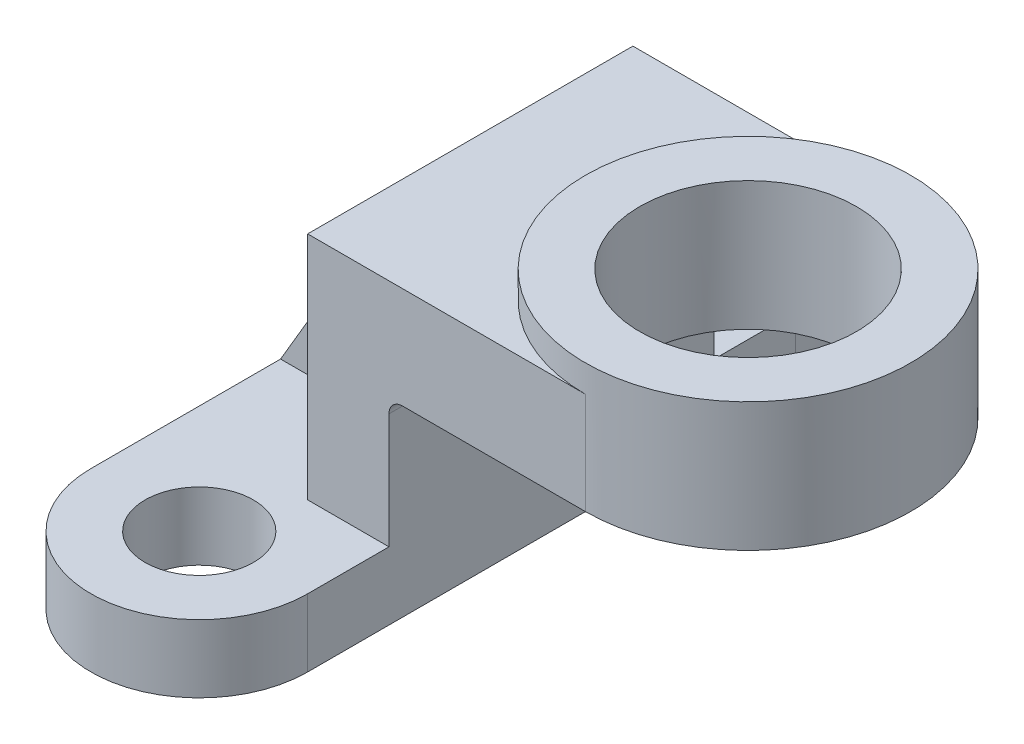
ISO-10303-21;
HEADER;
FILE_DESCRIPTION(('STEP AP214'),'2;1');
FILE_NAME('part.step','',(''),(''),'','','');
FILE_SCHEMA(('AUTOMOTIVE_DESIGN { 1 0 10303 214 1 1 1 1 }'));
ENDSEC;
DATA;
#1=APPLICATION_CONTEXT('core data for automotive mechanical design processes');
#2=APPLICATION_PROTOCOL_DEFINITION('international standard','automotive_design',2000,#1);
#3=PRODUCT_CONTEXT('',#1,'mechanical');
#4=PRODUCT('Part','Part','',(#3));
#5=PRODUCT_RELATED_PRODUCT_CATEGORY('part','',(#4));
#6=PRODUCT_DEFINITION_FORMATION('','',#4);
#7=PRODUCT_DEFINITION_CONTEXT('part definition',#1,'design');
#8=PRODUCT_DEFINITION('design','',#6,#7);
#9=PRODUCT_DEFINITION_SHAPE('','',#8);
#10=(LENGTH_UNIT() NAMED_UNIT(*) SI_UNIT(.MILLI.,.METRE.));
#11=(NAMED_UNIT(*) PLANE_ANGLE_UNIT() SI_UNIT($,.RADIAN.));
#12=(NAMED_UNIT(*) SI_UNIT($,.STERADIAN.) SOLID_ANGLE_UNIT());
#13=UNCERTAINTY_MEASURE_WITH_UNIT(LENGTH_MEASURE(1.E-05),#10,'distance_accuracy_value','');
#14=(GEOMETRIC_REPRESENTATION_CONTEXT(3) GLOBAL_UNCERTAINTY_ASSIGNED_CONTEXT((#13)) GLOBAL_UNIT_ASSIGNED_CONTEXT((#10,
#11,#12)) REPRESENTATION_CONTEXT('',''));
#15=CARTESIAN_POINT('',(0.,0.,0.));
#16=DIRECTION('',(0.,0.,1.));
#17=DIRECTION('',(1.,0.,0.));
#18=AXIS2_PLACEMENT_3D('',#15,#16,#17);
#19=CARTESIAN_POINT('',(0.,10.,0.));
#20=DIRECTION('',(0.,1.,0.));
#21=DIRECTION('',(0.,0.,1.));
#22=AXIS2_PLACEMENT_3D('',#19,#20,#21);
#23=PLANE('',#22);
#24=CARTESIAN_POINT('',(0.,10.,-36.));
#25=DIRECTION('',(0.,1.,0.));
#26=DIRECTION('',(0.,0.,1.));
#27=AXIS2_PLACEMENT_3D('',#24,#25,#26);
#28=CIRCLE('',#27,8.);
#29=CARTESIAN_POINT('',(0.,10.,-28.));
#30=VERTEX_POINT('',#29);
#31=EDGE_CURVE('E201',#30,#30,#28,.T.);
#32=ORIENTED_EDGE('',*,*,#31,.F.);
#33=EDGE_LOOP('',(#32));
#34=FACE_BOUND('',#33,.T.);
#35=DIRECTION('',(0.,0.,1.));
#36=VECTOR('',#35,1.);
#37=CARTESIAN_POINT('',(-16.,10.,0.));
#38=LINE('',#37,#36);
#39=CARTESIAN_POINT('',(-16.,10.,-36.));
#40=VERTEX_POINT('',#39);
#41=CARTESIAN_POINT('',(-16.,10.,-8.));
#42=VERTEX_POINT('',#41);
#43=EDGE_CURVE('E211',#40,#42,#38,.T.);
#44=ORIENTED_EDGE('',*,*,#43,.T.);
#45=DIRECTION('',(1.,0.,0.));
#46=VECTOR('',#45,1.);
#47=CARTESIAN_POINT('',(0.,10.,-8.));
#48=LINE('',#47,#46);
#49=CARTESIAN_POINT('',(4.,10.,-8.));
#50=VERTEX_POINT('',#49);
#51=EDGE_CURVE('E164',#42,#50,#48,.T.);
#52=ORIENTED_EDGE('',*,*,#51,.T.);
#53=DIRECTION('',(0.,0.,1.));
#54=VECTOR('',#53,1.);
#55=CARTESIAN_POINT('',(4.,10.,-24.));
#56=LINE('',#55,#54);
#57=CARTESIAN_POINT('',(4.,10.,-24.));
#58=VERTEX_POINT('',#57);
#59=EDGE_CURVE('E173',#58,#50,#56,.T.);
#60=ORIENTED_EDGE('',*,*,#59,.F.);
#61=DIRECTION('',(1.,0.,0.));
#62=VECTOR('',#61,1.);
#63=CARTESIAN_POINT('',(4.,10.,-24.));
#64=LINE('',#63,#62);
#65=CARTESIAN_POINT('',(16.,10.,-24.));
#66=VERTEX_POINT('',#65);
#67=EDGE_CURVE('E304',#58,#66,#64,.T.);
#68=ORIENTED_EDGE('',*,*,#67,.T.);
#69=DIRECTION('',(0.,0.,1.));
#70=VECTOR('',#69,1.);
#71=CARTESIAN_POINT('',(16.,10.,0.));
#72=LINE('',#71,#70);
#73=CARTESIAN_POINT('',(16.,10.,-36.));
#74=VERTEX_POINT('',#73);
#75=EDGE_CURVE('E220',#74,#66,#72,.T.);
#76=ORIENTED_EDGE('',*,*,#75,.F.);
#77=CARTESIAN_POINT('',(0.,10.,-36.));
#78=DIRECTION('',(0.,1.,0.));
#79=DIRECTION('',(0.,0.,1.));
#80=AXIS2_PLACEMENT_3D('',#77,#78,#79);
#81=CIRCLE('',#80,16.);
#82=EDGE_CURVE('E205',#74,#40,#81,.T.);
#83=ORIENTED_EDGE('',*,*,#82,.T.);
#84=EDGE_LOOP('',(#44,#52,#60,#68,#76,#83));
#85=FACE_BOUND('',#84,.T.);
#86=ADVANCED_FACE('F45',(#34,#85),#23,.T.);
#87=CARTESIAN_POINT('',(4.,44.,-24.));
#88=DIRECTION('',(-1.,0.,0.));
#89=DIRECTION('',(0.,-1.,0.));
#90=AXIS2_PLACEMENT_3D('',#87,#88,#89);
#91=PLANE('',#90);
#92=ORIENTED_EDGE('',*,*,#59,.T.);
#93=DIRECTION('',(0.,1.,0.));
#94=VECTOR('',#93,1.);
#95=CARTESIAN_POINT('',(4.,44.,-8.));
#96=LINE('',#95,#94);
#97=CARTESIAN_POINT('',(4.,44.,-8.));
#98=VERTEX_POINT('',#97);
#99=EDGE_CURVE('E162',#50,#98,#96,.T.);
#100=ORIENTED_EDGE('',*,*,#99,.T.);
#101=DIRECTION('',(0.,0.,1.));
#102=VECTOR('',#101,1.);
#103=CARTESIAN_POINT('',(4.,44.,-24.));
#104=LINE('',#103,#102);
#105=CARTESIAN_POINT('',(4.,44.,-24.));
#106=VERTEX_POINT('',#105);
#107=EDGE_CURVE('E156',#106,#98,#104,.T.);
#108=ORIENTED_EDGE('',*,*,#107,.F.);
#109=DIRECTION('',(0.,-1.,0.));
#110=VECTOR('',#109,1.);
#111=CARTESIAN_POINT('',(4.,44.,-24.));
#112=LINE('',#111,#110);
#113=EDGE_CURVE('E198',#106,#58,#112,.T.);
#114=ORIENTED_EDGE('',*,*,#113,.T.);
#115=EDGE_LOOP('',(#92,#100,#108,#114));
#116=FACE_BOUND('',#115,.T.);
#117=ADVANCED_FACE('F169',(#116),#91,.T.);
#118=CARTESIAN_POINT('',(0.,10.,-36.));
#119=DIRECTION('',(0.,-1.,0.));
#120=DIRECTION('',(0.,0.,-1.));
#121=AXIS2_PLACEMENT_3D('',#118,#119,#120);
#122=CYLINDRICAL_SURFACE('',#121,16.);
#123=CARTESIAN_POINT('',(0.,0.,-36.));
#124=DIRECTION('',(0.,1.,0.));
#125=DIRECTION('',(0.,0.,1.));
#126=AXIS2_PLACEMENT_3D('',#123,#124,#125);
#127=CIRCLE('',#126,16.);
#128=CARTESIAN_POINT('',(16.,0.,-36.));
#129=VERTEX_POINT('',#128);
#130=CARTESIAN_POINT('',(-16.,0.,-36.));
#131=VERTEX_POINT('',#130);
#132=EDGE_CURVE('E233',#129,#131,#127,.T.);
#133=ORIENTED_EDGE('',*,*,#132,.T.);
#134=DIRECTION('',(0.,-1.,0.));
#135=VECTOR('',#134,1.);
#136=CARTESIAN_POINT('',(-16.,10.,-36.));
#137=LINE('',#136,#135);
#138=EDGE_CURVE('E11',#40,#131,#137,.T.);
#139=ORIENTED_EDGE('',*,*,#138,.F.);
#140=ORIENTED_EDGE('',*,*,#82,.F.);
#141=DIRECTION('',(0.,-1.,0.));
#142=VECTOR('',#141,1.);
#143=CARTESIAN_POINT('',(16.,10.,-36.));
#144=LINE('',#143,#142);
#145=EDGE_CURVE('E228',#74,#129,#144,.T.);
#146=ORIENTED_EDGE('',*,*,#145,.T.);
#147=EDGE_LOOP('',(#133,#139,#140,#146));
#148=FACE_BOUND('',#147,.T.);
#149=ADVANCED_FACE('F373',(#148),#122,.T.);
#150=CARTESIAN_POINT('',(-16.,10.,0.));
#151=DIRECTION('',(1.,0.,0.));
#152=DIRECTION('',(0.,0.,-1.));
#153=AXIS2_PLACEMENT_3D('',#150,#151,#152);
#154=PLANE('',#153);
#155=CARTESIAN_POINT('',(-16.,10.,8.));
#156=VERTEX_POINT('',#155);
#157=CARTESIAN_POINT('',(-16.,10.,36.));
#158=VERTEX_POINT('',#157);
#159=EDGE_CURVE('E210',#156,#158,#38,.T.);
#160=ORIENTED_EDGE('',*,*,#159,.F.);
#161=DIRECTION('',(0.,0.,1.));
#162=VECTOR('',#161,1.);
#163=CARTESIAN_POINT('',(-16.,10.,0.));
#164=LINE('',#163,#162);
#165=EDGE_CURVE('E344',#42,#156,#164,.T.);
#166=ORIENTED_EDGE('',*,*,#165,.F.);
#167=ORIENTED_EDGE('',*,*,#43,.F.);
#168=ORIENTED_EDGE('',*,*,#138,.T.);
#169=DIRECTION('',(0.,0.,1.));
#170=VECTOR('',#169,1.);
#171=CARTESIAN_POINT('',(-16.,0.,0.));
#172=LINE('',#171,#170);
#173=CARTESIAN_POINT('',(-16.,0.,36.));
#174=VERTEX_POINT('',#173);
#175=EDGE_CURVE('E237',#131,#174,#172,.T.);
#176=ORIENTED_EDGE('',*,*,#175,.T.);
#177=DIRECTION('',(0.,-1.,0.));
#178=VECTOR('',#177,1.);
#179=CARTESIAN_POINT('',(-16.,10.,36.));
#180=LINE('',#179,#178);
#181=EDGE_CURVE('E55',#158,#174,#180,.T.);
#182=ORIENTED_EDGE('',*,*,#181,.F.);
#183=EDGE_LOOP('',(#160,#166,#167,#168,#176,#182));
#184=FACE_BOUND('',#183,.T.);
#185=ADVANCED_FACE('F371',(#184),#154,.F.);
#186=CARTESIAN_POINT('',(0.,10.,36.));
#187=DIRECTION('',(0.,-1.,0.));
#188=DIRECTION('',(0.,0.,-1.));
#189=AXIS2_PLACEMENT_3D('',#186,#187,#188);
#190=CYLINDRICAL_SURFACE('',#189,16.);
#191=CARTESIAN_POINT('',(0.,0.,36.));
#192=DIRECTION('',(0.,1.,0.));
#193=DIRECTION('',(0.,0.,1.));
#194=AXIS2_PLACEMENT_3D('',#191,#192,#193);
#195=CIRCLE('',#194,16.);
#196=CARTESIAN_POINT('',(16.,0.,36.));
#197=VERTEX_POINT('',#196);
#198=EDGE_CURVE('E240',#174,#197,#195,.T.);
#199=ORIENTED_EDGE('',*,*,#198,.T.);
#200=DIRECTION('',(0.,-1.,0.));
#201=VECTOR('',#200,1.);
#202=CARTESIAN_POINT('',(16.,10.,36.));
#203=LINE('',#202,#201);
#204=CARTESIAN_POINT('',(16.,10.,36.));
#205=VERTEX_POINT('',#204);
#206=EDGE_CURVE('E252',#205,#197,#203,.T.);
#207=ORIENTED_EDGE('',*,*,#206,.F.);
#208=CARTESIAN_POINT('',(0.,10.,36.));
#209=DIRECTION('',(0.,1.,0.));
#210=DIRECTION('',(0.,0.,1.));
#211=AXIS2_PLACEMENT_3D('',#208,#209,#210);
#212=CIRCLE('',#211,16.);
#213=EDGE_CURVE('E215',#158,#205,#212,.T.);
#214=ORIENTED_EDGE('',*,*,#213,.F.);
#215=ORIENTED_EDGE('',*,*,#181,.T.);
#216=EDGE_LOOP('',(#199,#207,#214,#215));
#217=FACE_BOUND('',#216,.T.);
#218=ADVANCED_FACE('F262',(#217),#190,.T.);
#219=CARTESIAN_POINT('',(16.,10.,0.));
#220=DIRECTION('',(1.,0.,0.));
#221=DIRECTION('',(0.,0.,-1.));
#222=AXIS2_PLACEMENT_3D('',#219,#220,#221);
#223=PLANE('',#222);
#224=ORIENTED_EDGE('',*,*,#206,.T.);
#225=DIRECTION('',(0.,0.,1.));
#226=VECTOR('',#225,1.);
#227=CARTESIAN_POINT('',(16.,0.,0.));
#228=LINE('',#227,#226);
#229=EDGE_CURVE('E244',#129,#197,#228,.T.);
#230=ORIENTED_EDGE('',*,*,#229,.F.);
#231=ORIENTED_EDGE('',*,*,#145,.F.);
#232=ORIENTED_EDGE('',*,*,#75,.T.);
#233=DIRECTION('',(0.,1.,0.));
#234=VECTOR('',#233,1.);
#235=CARTESIAN_POINT('',(16.,10.,-24.));
#236=LINE('',#235,#234);
#237=CARTESIAN_POINT('',(16.,27.,-24.));
#238=VERTEX_POINT('',#237);
#239=EDGE_CURVE('E70',#66,#238,#236,.T.);
#240=ORIENTED_EDGE('',*,*,#239,.T.);
#241=DIRECTION('',(0.,0.,1.));
#242=VECTOR('',#241,1.);
#243=CARTESIAN_POINT('',(16.,27.,-24.));
#244=LINE('',#243,#242);
#245=CARTESIAN_POINT('',(16.,27.,24.));
#246=VERTEX_POINT('',#245);
#247=EDGE_CURVE('E192',#238,#246,#244,.T.);
#248=ORIENTED_EDGE('',*,*,#247,.T.);
#249=DIRECTION('',(0.,1.,0.));
#250=VECTOR('',#249,1.);
#251=CARTESIAN_POINT('',(16.,10.,24.));
#252=LINE('',#251,#250);
#253=CARTESIAN_POINT('',(16.,10.,24.));
#254=VERTEX_POINT('',#253);
#255=EDGE_CURVE('E275',#254,#246,#252,.T.);
#256=ORIENTED_EDGE('',*,*,#255,.F.);
#257=EDGE_CURVE('E219',#254,#205,#72,.T.);
#258=ORIENTED_EDGE('',*,*,#257,.T.);
#259=EDGE_LOOP('',(#224,#230,#231,#232,#240,#248,#256,#258));
#260=FACE_BOUND('',#259,.T.);
#261=ADVANCED_FACE('F272',(#260),#223,.T.);
#262=CARTESIAN_POINT('',(0.,10.,-36.));
#263=DIRECTION('',(0.,-1.,0.));
#264=DIRECTION('',(0.,0.,-1.));
#265=AXIS2_PLACEMENT_3D('',#262,#263,#264);
#266=CYLINDRICAL_SURFACE('',#265,8.);
#267=ORIENTED_EDGE('',*,*,#31,.T.);
#268=EDGE_LOOP('',(#267));
#269=FACE_BOUND('',#268,.T.);
#270=CARTESIAN_POINT('',(0.,0.,-36.));
#271=DIRECTION('',(0.,1.,0.));
#272=DIRECTION('',(0.,0.,1.));
#273=AXIS2_PLACEMENT_3D('',#270,#271,#272);
#274=CIRCLE('',#273,8.);
#275=CARTESIAN_POINT('',(0.,0.,-28.));
#276=VERTEX_POINT('',#275);
#277=EDGE_CURVE('E229',#276,#276,#274,.T.);
#278=ORIENTED_EDGE('',*,*,#277,.F.);
#279=EDGE_LOOP('',(#278));
#280=FACE_BOUND('',#279,.T.);
#281=ADVANCED_FACE('F47',(#269,#280),#266,.F.);
#282=CARTESIAN_POINT('',(0.,10.,36.));
#283=DIRECTION('',(0.,-1.,0.));
#284=DIRECTION('',(0.,0.,-1.));
#285=AXIS2_PLACEMENT_3D('',#282,#283,#284);
#286=CYLINDRICAL_SURFACE('',#285,8.);
#287=CARTESIAN_POINT('',(0.,10.,36.));
#288=DIRECTION('',(0.,1.,0.));
#289=DIRECTION('',(0.,0.,1.));
#290=AXIS2_PLACEMENT_3D('',#287,#288,#289);
#291=CIRCLE('',#290,8.);
#292=CARTESIAN_POINT('',(0.,10.,44.));
#293=VERTEX_POINT('',#292);
#294=EDGE_CURVE('E224',#293,#293,#291,.T.);
#295=ORIENTED_EDGE('',*,*,#294,.T.);
#296=EDGE_LOOP('',(#295));
#297=FACE_BOUND('',#296,.T.);
#298=CARTESIAN_POINT('',(0.,0.,36.));
#299=DIRECTION('',(0.,1.,0.));
#300=DIRECTION('',(0.,0.,1.));
#301=AXIS2_PLACEMENT_3D('',#298,#299,#300);
#302=CIRCLE('',#301,8.);
#303=CARTESIAN_POINT('',(0.,0.,44.));
#304=VERTEX_POINT('',#303);
#305=EDGE_CURVE('E206',#304,#304,#302,.T.);
#306=ORIENTED_EDGE('',*,*,#305,.F.);
#307=EDGE_LOOP('',(#306));
#308=FACE_BOUND('',#307,.T.);
#309=ADVANCED_FACE('F396',(#297,#308),#286,.F.);
#310=DIRECTION('',(1.,0.,0.));
#311=VECTOR('',#310,1.);
#312=CARTESIAN_POINT('',(0.,10.,8.));
#313=LINE('',#312,#311);
#314=CARTESIAN_POINT('',(4.,10.,8.));
#315=VERTEX_POINT('',#314);
#316=EDGE_CURVE('E284',#156,#315,#313,.T.);
#317=ORIENTED_EDGE('',*,*,#316,.F.);
#318=ORIENTED_EDGE('',*,*,#159,.T.);
#319=ORIENTED_EDGE('',*,*,#213,.T.);
#320=ORIENTED_EDGE('',*,*,#257,.F.);
#321=DIRECTION('',(1.,0.,0.));
#322=VECTOR('',#321,1.);
#323=CARTESIAN_POINT('',(4.,10.,24.));
#324=LINE('',#323,#322);
#325=CARTESIAN_POINT('',(4.,10.,24.));
#326=VERTEX_POINT('',#325);
#327=EDGE_CURVE('E327',#326,#254,#324,.T.);
#328=ORIENTED_EDGE('',*,*,#327,.F.);
#329=EDGE_CURVE('E183',#315,#326,#56,.T.);
#330=ORIENTED_EDGE('',*,*,#329,.F.);
#331=EDGE_LOOP('',(#317,#318,#319,#320,#328,#330));
#332=FACE_BOUND('',#331,.T.);
#333=ORIENTED_EDGE('',*,*,#294,.F.);
#334=EDGE_LOOP('',(#333));
#335=FACE_BOUND('',#334,.T.);
#336=ADVANCED_FACE('F281',(#332,#335),#23,.T.);
#337=CARTESIAN_POINT('',(0.,0.,0.));
#338=DIRECTION('',(0.,1.,0.));
#339=DIRECTION('',(0.,0.,1.));
#340=AXIS2_PLACEMENT_3D('',#337,#338,#339);
#341=PLANE('',#340);
#342=ORIENTED_EDGE('',*,*,#198,.F.);
#343=ORIENTED_EDGE('',*,*,#175,.F.);
#344=ORIENTED_EDGE('',*,*,#132,.F.);
#345=ORIENTED_EDGE('',*,*,#229,.T.);
#346=EDGE_LOOP('',(#342,#343,#344,#345));
#347=FACE_BOUND('',#346,.T.);
#348=ORIENTED_EDGE('',*,*,#305,.T.);
#349=EDGE_LOOP('',(#348));
#350=FACE_BOUND('',#349,.T.);
#351=ORIENTED_EDGE('',*,*,#277,.T.);
#352=EDGE_LOOP('',(#351));
#353=FACE_BOUND('',#352,.T.);
#354=ADVANCED_FACE('F267',(#347,#350,#353),#341,.F.);
#355=DIRECTION('',(0.,1.,0.));
#356=VECTOR('',#355,1.);
#357=CARTESIAN_POINT('',(4.,44.,8.));
#358=LINE('',#357,#356);
#359=CARTESIAN_POINT('',(4.,44.,8.));
#360=VERTEX_POINT('',#359);
#361=EDGE_CURVE('E349',#315,#360,#358,.T.);
#362=ORIENTED_EDGE('',*,*,#361,.F.);
#363=ORIENTED_EDGE('',*,*,#329,.T.);
#364=DIRECTION('',(0.,-1.,0.));
#365=VECTOR('',#364,1.);
#366=CARTESIAN_POINT('',(4.,44.,24.));
#367=LINE('',#366,#365);
#368=CARTESIAN_POINT('',(4.,44.,24.));
#369=VERTEX_POINT('',#368);
#370=EDGE_CURVE('E307',#369,#326,#367,.T.);
#371=ORIENTED_EDGE('',*,*,#370,.F.);
#372=EDGE_CURVE('E157',#360,#369,#104,.T.);
#373=ORIENTED_EDGE('',*,*,#372,.F.);
#374=EDGE_LOOP('',(#362,#363,#371,#373));
#375=FACE_BOUND('',#374,.T.);
#376=ADVANCED_FACE('F360',(#375),#91,.T.);
#377=CARTESIAN_POINT('',(45.,44.,-24.));
#378=DIRECTION('',(0.,1.,0.));
#379=DIRECTION('',(-1.,0.,0.));
#380=AXIS2_PLACEMENT_3D('',#377,#378,#379);
#381=PLANE('',#380);
#382=DIRECTION('',(-1.,0.,0.));
#383=VECTOR('',#382,1.);
#384=CARTESIAN_POINT('',(45.,44.,24.));
#385=LINE('',#384,#383);
#386=CARTESIAN_POINT('',(45.,44.,24.));
#387=VERTEX_POINT('',#386);
#388=EDGE_CURVE('E311',#387,#369,#385,.T.);
#389=ORIENTED_EDGE('',*,*,#388,.F.);
#390=CARTESIAN_POINT('',(45.,44.,0.));
#391=DIRECTION('',(0.,1.,0.));
#392=DIRECTION('',(-1.,0.,0.));
#393=AXIS2_PLACEMENT_3D('',#390,#391,#392);
#394=CIRCLE('',#393,24.);
#395=CARTESIAN_POINT('',(45.,44.,-24.));
#396=VERTEX_POINT('',#395);
#397=EDGE_CURVE('E330',#396,#387,#394,.T.);
#398=ORIENTED_EDGE('',*,*,#397,.F.);
#399=DIRECTION('',(-1.,0.,0.));
#400=VECTOR('',#399,1.);
#401=CARTESIAN_POINT('',(45.,44.,-24.));
#402=LINE('',#401,#400);
#403=EDGE_CURVE('E180',#396,#106,#402,.T.);
#404=ORIENTED_EDGE('',*,*,#403,.T.);
#405=ORIENTED_EDGE('',*,*,#107,.T.);
#406=EDGE_CURVE('E148',#98,#360,#104,.T.);
#407=ORIENTED_EDGE('',*,*,#406,.T.);
#408=ORIENTED_EDGE('',*,*,#372,.T.);
#409=EDGE_LOOP('',(#389,#398,#404,#405,#407,#408));
#410=FACE_BOUND('',#409,.T.);
#411=ADVANCED_FACE('F177',(#410),#381,.T.);
#412=CARTESIAN_POINT('',(18.,29.,-24.));
#413=DIRECTION('',(0.,-1.,0.));
#414=DIRECTION('',(0.,0.,-1.));
#415=AXIS2_PLACEMENT_3D('',#412,#413,#414);
#416=PLANE('',#415);
#417=CARTESIAN_POINT('',(45.,29.,0.));
#418=DIRECTION('',(0.,-1.,0.));
#419=DIRECTION('',(0.,0.,-1.));
#420=AXIS2_PLACEMENT_3D('',#417,#418,#419);
#421=CIRCLE('',#420,16.);
#422=CARTESIAN_POINT('',(45.,29.,-16.));
#423=VERTEX_POINT('',#422);
#424=EDGE_CURVE('E340',#423,#423,#421,.F.);
#425=ORIENTED_EDGE('',*,*,#424,.T.);
#426=EDGE_LOOP('',(#425));
#427=FACE_BOUND('',#426,.T.);
#428=DIRECTION('',(1.,0.,0.));
#429=VECTOR('',#428,1.);
#430=CARTESIAN_POINT('',(18.,29.,-24.));
#431=LINE('',#430,#429);
#432=CARTESIAN_POINT('',(18.,29.,-24.));
#433=VERTEX_POINT('',#432);
#434=CARTESIAN_POINT('',(45.,29.,-24.));
#435=VERTEX_POINT('',#434);
#436=EDGE_CURVE('E295',#433,#435,#431,.T.);
#437=ORIENTED_EDGE('',*,*,#436,.T.);
#438=CARTESIAN_POINT('',(45.,29.,0.));
#439=DIRECTION('',(0.,1.,0.));
#440=DIRECTION('',(-1.,0.,0.));
#441=AXIS2_PLACEMENT_3D('',#438,#439,#440);
#442=CIRCLE('',#441,24.);
#443=CARTESIAN_POINT('',(45.,29.,24.));
#444=VERTEX_POINT('',#443);
#445=EDGE_CURVE('E333',#444,#435,#442,.T.);
#446=ORIENTED_EDGE('',*,*,#445,.F.);
#447=DIRECTION('',(1.,0.,0.));
#448=VECTOR('',#447,1.);
#449=CARTESIAN_POINT('',(18.,29.,24.));
#450=LINE('',#449,#448);
#451=CARTESIAN_POINT('',(18.,29.,24.));
#452=VERTEX_POINT('',#451);
#453=EDGE_CURVE('E318',#452,#444,#450,.T.);
#454=ORIENTED_EDGE('',*,*,#453,.F.);
#455=DIRECTION('',(0.,0.,1.));
#456=VECTOR('',#455,1.);
#457=CARTESIAN_POINT('',(18.,29.,-24.));
#458=LINE('',#457,#456);
#459=EDGE_CURVE('E188',#433,#452,#458,.T.);
#460=ORIENTED_EDGE('',*,*,#459,.F.);
#461=EDGE_LOOP('',(#437,#446,#454,#460));
#462=FACE_BOUND('',#461,.T.);
#463=ADVANCED_FACE('F377',(#427,#462),#416,.T.);
#464=CARTESIAN_POINT('',(18.,27.,-24.));
#465=DIRECTION('',(0.,0.,1.));
#466=DIRECTION('',(1.,0.,0.));
#467=AXIS2_PLACEMENT_3D('',#464,#465,#466);
#468=CYLINDRICAL_SURFACE('',#467,2.);
#469=CARTESIAN_POINT('',(18.,27.,24.));
#470=DIRECTION('',(0.,0.,-1.));
#471=DIRECTION('',(1.,0.,0.));
#472=AXIS2_PLACEMENT_3D('',#469,#470,#471);
#473=CIRCLE('',#472,2.);
#474=EDGE_CURVE('E322',#246,#452,#473,.T.);
#475=ORIENTED_EDGE('',*,*,#474,.F.);
#476=ORIENTED_EDGE('',*,*,#247,.F.);
#477=CARTESIAN_POINT('',(18.,27.,-24.));
#478=DIRECTION('',(0.,0.,-1.));
#479=DIRECTION('',(1.,0.,0.));
#480=AXIS2_PLACEMENT_3D('',#477,#478,#479);
#481=CIRCLE('',#480,2.);
#482=EDGE_CURVE('E299',#238,#433,#481,.T.);
#483=ORIENTED_EDGE('',*,*,#482,.T.);
#484=ORIENTED_EDGE('',*,*,#459,.T.);
#485=EDGE_LOOP('',(#475,#476,#483,#484));
#486=FACE_BOUND('',#485,.T.);
#487=ADVANCED_FACE('F375',(#486),#468,.F.);
#488=CARTESIAN_POINT('',(18.,27.,-24.));
#489=DIRECTION('',(0.,0.,1.));
#490=DIRECTION('',(1.,0.,0.));
#491=AXIS2_PLACEMENT_3D('',#488,#489,#490);
#492=PLANE('',#491);
#493=ORIENTED_EDGE('',*,*,#67,.F.);
#494=ORIENTED_EDGE('',*,*,#113,.F.);
#495=ORIENTED_EDGE('',*,*,#403,.F.);
#496=DIRECTION('',(0.,1.,0.));
#497=VECTOR('',#496,1.);
#498=CARTESIAN_POINT('',(45.,29.,-24.));
#499=LINE('',#498,#497);
#500=EDGE_CURVE('E292',#435,#396,#499,.T.);
#501=ORIENTED_EDGE('',*,*,#500,.F.);
#502=ORIENTED_EDGE('',*,*,#436,.F.);
#503=ORIENTED_EDGE('',*,*,#482,.F.);
#504=ORIENTED_EDGE('',*,*,#239,.F.);
#505=EDGE_LOOP('',(#493,#494,#495,#501,#502,#503,#504));
#506=FACE_BOUND('',#505,.T.);
#507=ADVANCED_FACE('F365',(#506),#492,.F.);
#508=CARTESIAN_POINT('',(18.,27.,24.));
#509=DIRECTION('',(0.,0.,1.));
#510=DIRECTION('',(1.,0.,0.));
#511=AXIS2_PLACEMENT_3D('',#508,#509,#510);
#512=PLANE('',#511);
#513=ORIENTED_EDGE('',*,*,#327,.T.);
#514=ORIENTED_EDGE('',*,*,#255,.T.);
#515=ORIENTED_EDGE('',*,*,#474,.T.);
#516=ORIENTED_EDGE('',*,*,#453,.T.);
#517=DIRECTION('',(0.,1.,0.));
#518=VECTOR('',#517,1.);
#519=CARTESIAN_POINT('',(45.,29.,24.));
#520=LINE('',#519,#518);
#521=EDGE_CURVE('E314',#444,#387,#520,.T.);
#522=ORIENTED_EDGE('',*,*,#521,.T.);
#523=ORIENTED_EDGE('',*,*,#388,.T.);
#524=ORIENTED_EDGE('',*,*,#370,.T.);
#525=EDGE_LOOP('',(#513,#514,#515,#516,#522,#523,#524));
#526=FACE_BOUND('',#525,.T.);
#527=ADVANCED_FACE('F362',(#526),#512,.T.);
#528=CARTESIAN_POINT('',(45.,29.,0.));
#529=DIRECTION('',(0.,1.,0.));
#530=DIRECTION('',(-1.,0.,0.));
#531=AXIS2_PLACEMENT_3D('',#528,#529,#530);
#532=CYLINDRICAL_SURFACE('',#531,24.);
#533=ORIENTED_EDGE('',*,*,#445,.T.);
#534=ORIENTED_EDGE('',*,*,#500,.T.);
#535=ORIENTED_EDGE('',*,*,#397,.T.);
#536=ORIENTED_EDGE('',*,*,#521,.F.);
#537=EDGE_LOOP('',(#533,#534,#535,#536));
#538=FACE_BOUND('',#537,.T.);
#539=CARTESIAN_POINT('',(45.,48.,0.));
#540=DIRECTION('',(0.,1.,0.));
#541=DIRECTION('',(-1.,0.,0.));
#542=AXIS2_PLACEMENT_3D('',#539,#540,#541);
#543=CIRCLE('',#542,24.);
#544=CARTESIAN_POINT('',(21.,48.,0.));
#545=VERTEX_POINT('',#544);
#546=EDGE_CURVE('E336',#545,#545,#543,.T.);
#547=ORIENTED_EDGE('',*,*,#546,.F.);
#548=EDGE_LOOP('',(#547));
#549=FACE_BOUND('',#548,.T.);
#550=ADVANCED_FACE('F459',(#538,#549),#532,.T.);
#551=CARTESIAN_POINT('',(45.,48.,0.));
#552=DIRECTION('',(0.,1.,0.));
#553=DIRECTION('',(-1.,0.,0.));
#554=AXIS2_PLACEMENT_3D('',#551,#552,#553);
#555=PLANE('',#554);
#556=CARTESIAN_POINT('',(45.,48.,0.));
#557=DIRECTION('',(0.,1.,0.));
#558=DIRECTION('',(-1.,0.,0.));
#559=AXIS2_PLACEMENT_3D('',#556,#557,#558);
#560=CIRCLE('',#559,16.);
#561=CARTESIAN_POINT('',(29.,48.,0.));
#562=VERTEX_POINT('',#561);
#563=EDGE_CURVE('E49',#562,#562,#560,.F.);
#564=ORIENTED_EDGE('',*,*,#563,.T.);
#565=EDGE_LOOP('',(#564));
#566=FACE_BOUND('',#565,.T.);
#567=ORIENTED_EDGE('',*,*,#546,.T.);
#568=EDGE_LOOP('',(#567));
#569=FACE_BOUND('',#568,.T.);
#570=ADVANCED_FACE('F485',(#566,#569),#555,.T.);
#571=CARTESIAN_POINT('',(45.,58.,0.));
#572=DIRECTION('',(0.,-1.,0.));
#573=DIRECTION('',(1.,0.,0.));
#574=AXIS2_PLACEMENT_3D('',#571,#572,#573);
#575=CYLINDRICAL_SURFACE('',#574,16.);
#576=ORIENTED_EDGE('',*,*,#424,.F.);
#577=EDGE_LOOP('',(#576));
#578=FACE_BOUND('',#577,.T.);
#579=ORIENTED_EDGE('',*,*,#563,.F.);
#580=EDGE_LOOP('',(#579));
#581=FACE_BOUND('',#580,.T.);
#582=ADVANCED_FACE('F481',(#578,#581),#575,.F.);
#583=CARTESIAN_POINT('',(4.,44.,0.));
#584=DIRECTION('',(-0.861934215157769,0.507020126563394,0.));
#585=DIRECTION('',(-0.507020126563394,-0.861934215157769,0.));
#586=AXIS2_PLACEMENT_3D('',#583,#584,#585);
#587=PLANE('',#586);
#588=DIRECTION('',(-0.507020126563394,-0.861934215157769,0.));
#589=VECTOR('',#588,1.);
#590=CARTESIAN_POINT('',(4.,44.,-8.));
#591=LINE('',#590,#589);
#592=EDGE_CURVE('E151',#98,#42,#591,.T.);
#593=ORIENTED_EDGE('',*,*,#592,.T.);
#594=ORIENTED_EDGE('',*,*,#165,.T.);
#595=DIRECTION('',(-0.507020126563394,-0.861934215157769,0.));
#596=VECTOR('',#595,1.);
#597=CARTESIAN_POINT('',(4.,44.,8.));
#598=LINE('',#597,#596);
#599=EDGE_CURVE('E62',#360,#156,#598,.T.);
#600=ORIENTED_EDGE('',*,*,#599,.F.);
#601=ORIENTED_EDGE('',*,*,#406,.F.);
#602=EDGE_LOOP('',(#593,#594,#600,#601));
#603=FACE_BOUND('',#602,.T.);
#604=ADVANCED_FACE('F150',(#603),#587,.T.);
#605=CARTESIAN_POINT('',(26.5,24.,8.));
#606=DIRECTION('',(0.,0.,1.));
#607=DIRECTION('',(1.,0.,0.));
#608=AXIS2_PLACEMENT_3D('',#605,#606,#607);
#609=PLANE('',#608);
#610=ORIENTED_EDGE('',*,*,#599,.T.);
#611=ORIENTED_EDGE('',*,*,#316,.T.);
#612=ORIENTED_EDGE('',*,*,#361,.T.);
#613=EDGE_LOOP('',(#610,#611,#612));
#614=FACE_BOUND('',#613,.T.);
#615=ADVANCED_FACE('F356',(#614),#609,.T.);
#616=CARTESIAN_POINT('',(26.5,24.,-8.));
#617=DIRECTION('',(0.,0.,1.));
#618=DIRECTION('',(1.,0.,0.));
#619=AXIS2_PLACEMENT_3D('',#616,#617,#618);
#620=PLANE('',#619);
#621=ORIENTED_EDGE('',*,*,#51,.F.);
#622=ORIENTED_EDGE('',*,*,#592,.F.);
#623=ORIENTED_EDGE('',*,*,#99,.F.);
#624=EDGE_LOOP('',(#621,#622,#623));
#625=FACE_BOUND('',#624,.T.);
#626=ADVANCED_FACE('F161',(#625),#620,.F.);
#627=CLOSED_SHELL('',(#86,#117,#149,#185,#218,#261,#281,#309,#336,#354,#376,#411,#463,#487,#507,
#527,#550,#570,#582,#604,#615,#626));
#628=MANIFOLD_SOLID_BREP('B2',#627);
#629=ADVANCED_BREP_SHAPE_REPRESENTATION('',(#18,#628),#14);
#630=SHAPE_DEFINITION_REPRESENTATION(#9,#629);
ENDSEC;
END-ISO-10303-21;
